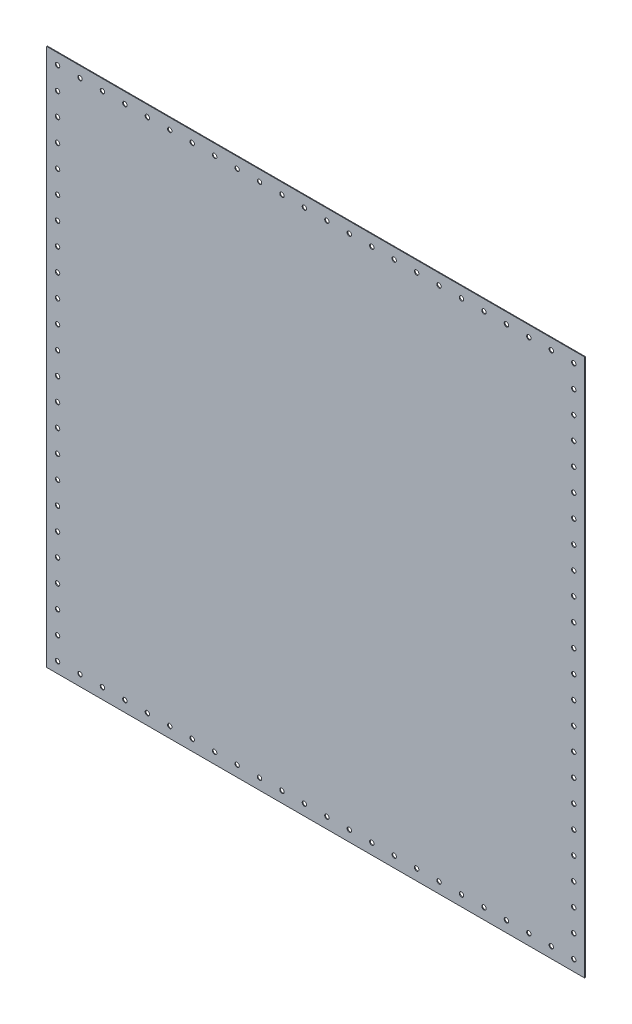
from build123d import *

# Parameters (mm, degrees)
SKETCH1_W           = 1196.975
SKETCH1_H           = 1196.975
BOSS_EXTRUDE1_DEPTH = 1.5875
SKETCH2_R           = 4.9022
CUT_EXTRUDE2_DEPTH  = 847.390628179


with BuildPart() as part:
    # Sketch1 → Boss-Extrude1 (new body)
    with BuildSketch(Plane.XY):
        Rectangle(SKETCH1_W, SKETCH1_H)
    extrude(amount=BOSS_EXTRUDE1_DEPTH)

    # Sketch2 → Cut-Extrude2 (cut, through all)
    with BuildSketch(Plane.XY):
        with Locations((574.3575, -574.3575)):
            Circle(SKETCH2_R)
        with Locations((-574.3575, -574.3575)):
            Circle(SKETCH2_R)
        with Locations((574.3575, -524.413369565)):
            Circle(SKETCH2_R)
        with Locations((-574.3575, -524.413369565)):
            Circle(SKETCH2_R)
        with Locations((574.3575, -474.46923913)):
            Circle(SKETCH2_R)
        with Locations((-574.3575, -474.46923913)):
            Circle(SKETCH2_R)
        with Locations((574.3575, -424.525108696)):
            Circle(SKETCH2_R)
        with Locations((-574.3575, -424.525108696)):
            Circle(SKETCH2_R)
        with Locations((574.3575, -374.580978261)):
            Circle(SKETCH2_R)
        with Locations((-574.3575, -374.580978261)):
            Circle(SKETCH2_R)
        with Locations((574.3575, -324.636847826)):
            Circle(SKETCH2_R)
        with Locations((-574.3575, -324.636847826)):
            Circle(SKETCH2_R)
        with Locations((574.3575, -274.692717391)):
            Circle(SKETCH2_R)
        with Locations((-574.3575, -274.692717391)):
            Circle(SKETCH2_R)
        with Locations((574.3575, -224.748586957)):
            Circle(SKETCH2_R)
        with Locations((-574.3575, -224.748586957)):
            Circle(SKETCH2_R)
        with Locations((574.3575, -174.804456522)):
            Circle(SKETCH2_R)
        with Locations((-574.3575, -174.804456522)):
            Circle(SKETCH2_R)
        with Locations((574.3575, -124.860326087)):
            Circle(SKETCH2_R)
        with Locations((-574.3575, -124.860326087)):
            Circle(SKETCH2_R)
        with Locations((574.3575, -74.916195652)):
            Circle(SKETCH2_R)
        with Locations((-574.3575, -74.916195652)):
            Circle(SKETCH2_R)
        with Locations((574.3575, -24.972065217)):
            Circle(SKETCH2_R)
        with Locations((-574.3575, -24.972065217)):
            Circle(SKETCH2_R)
        with Locations((574.3575, 24.972065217)):
            Circle(SKETCH2_R)
        with Locations((-574.3575, 24.972065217)):
            Circle(SKETCH2_R)
        with Locations((574.3575, 74.916195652)):
            Circle(SKETCH2_R)
        with Locations((-574.3575, 74.916195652)):
            Circle(SKETCH2_R)
        with Locations((574.3575, 124.860326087)):
            Circle(SKETCH2_R)
        with Locations((-574.3575, 124.860326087)):
            Circle(SKETCH2_R)
        with Locations((574.3575, 174.804456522)):
            Circle(SKETCH2_R)
        with Locations((-574.3575, 174.804456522)):
            Circle(SKETCH2_R)
        with Locations((574.3575, 224.748586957)):
            Circle(SKETCH2_R)
        with Locations((-574.3575, 224.748586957)):
            Circle(SKETCH2_R)
        with Locations((574.3575, 274.692717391)):
            Circle(SKETCH2_R)
        with Locations((-574.3575, 274.692717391)):
            Circle(SKETCH2_R)
        with Locations((574.3575, 324.636847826)):
            Circle(SKETCH2_R)
        with Locations((-574.3575, 324.636847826)):
            Circle(SKETCH2_R)
        with Locations((574.3575, 374.580978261)):
            Circle(SKETCH2_R)
        with Locations((-574.3575, 374.580978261)):
            Circle(SKETCH2_R)
        with Locations((574.3575, 424.525108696)):
            Circle(SKETCH2_R)
        with Locations((-574.3575, 424.525108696)):
            Circle(SKETCH2_R)
        with Locations((574.3575, 474.46923913)):
            Circle(SKETCH2_R)
        with Locations((-574.3575, 474.46923913)):
            Circle(SKETCH2_R)
        with Locations((574.3575, 524.413369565)):
            Circle(SKETCH2_R)
        with Locations((-574.3575, 524.413369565)):
            Circle(SKETCH2_R)
        with Locations((574.3575, 574.3575)):
            Circle(SKETCH2_R)
        with Locations((-574.3575, 574.3575)):
            Circle(SKETCH2_R)
        with Locations((-524.41336951, -574.3575)):
            Circle(SKETCH2_R)
        with Locations((-524.41336951, 574.3575)):
            Circle(SKETCH2_R)
        with Locations((-474.46923902, -574.3575)):
            Circle(SKETCH2_R)
        with Locations((-474.46923902, 574.3575)):
            Circle(SKETCH2_R)
        with Locations((-424.52510853, -574.3575)):
            Circle(SKETCH2_R)
        with Locations((-424.52510853, 574.3575)):
            Circle(SKETCH2_R)
        with Locations((-374.58097804, -574.3575)):
            Circle(SKETCH2_R)
        with Locations((-374.58097804, 574.3575)):
            Circle(SKETCH2_R)
        with Locations((-324.63684755, -574.3575)):
            Circle(SKETCH2_R)
        with Locations((-324.63684755, 574.3575)):
            Circle(SKETCH2_R)
        with Locations((-274.69271706, -574.3575)):
            Circle(SKETCH2_R)
        with Locations((-274.69271706, 574.3575)):
            Circle(SKETCH2_R)
        with Locations((-224.74858657, -574.3575)):
            Circle(SKETCH2_R)
        with Locations((-224.74858657, 574.3575)):
            Circle(SKETCH2_R)
        with Locations((-174.80445608, -574.3575)):
            Circle(SKETCH2_R)
        with Locations((-174.80445608, 574.3575)):
            Circle(SKETCH2_R)
        with Locations((-124.86032559, -574.3575)):
            Circle(SKETCH2_R)
        with Locations((-124.86032559, 574.3575)):
            Circle(SKETCH2_R)
        with Locations((-74.9161951, -574.3575)):
            Circle(SKETCH2_R)
        with Locations((-74.9161951, 574.3575)):
            Circle(SKETCH2_R)
        with Locations((-24.97206461, -574.3575)):
            Circle(SKETCH2_R)
        with Locations((-24.97206461, 574.3575)):
            Circle(SKETCH2_R)
        with Locations((24.97206588, -574.3575)):
            Circle(SKETCH2_R)
        with Locations((24.97206588, 574.3575)):
            Circle(SKETCH2_R)
        with Locations((74.91619637, -574.3575)):
            Circle(SKETCH2_R)
        with Locations((74.91619637, 574.3575)):
            Circle(SKETCH2_R)
        with Locations((124.86032686, -574.3575)):
            Circle(SKETCH2_R)
        with Locations((124.86032686, 574.3575)):
            Circle(SKETCH2_R)
        with Locations((174.80445735, -574.3575)):
            Circle(SKETCH2_R)
        with Locations((174.80445735, 574.3575)):
            Circle(SKETCH2_R)
        with Locations((224.74858784, -574.3575)):
            Circle(SKETCH2_R)
        with Locations((224.74858784, 574.3575)):
            Circle(SKETCH2_R)
        with Locations((274.69271833, -574.3575)):
            Circle(SKETCH2_R)
        with Locations((274.69271833, 574.3575)):
            Circle(SKETCH2_R)
        with Locations((324.63684882, -574.3575)):
            Circle(SKETCH2_R)
        with Locations((324.63684882, 574.3575)):
            Circle(SKETCH2_R)
        with Locations((374.58097931, -574.3575)):
            Circle(SKETCH2_R)
        with Locations((374.58097931, 574.3575)):
            Circle(SKETCH2_R)
        with Locations((424.5251098, -574.3575)):
            Circle(SKETCH2_R)
        with Locations((424.5251098, 574.3575)):
            Circle(SKETCH2_R)
        with Locations((474.46924029, -574.3575)):
            Circle(SKETCH2_R)
        with Locations((474.46924029, 574.3575)):
            Circle(SKETCH2_R)
        with Locations((524.41337078, -574.3575)):
            Circle(SKETCH2_R)
        with Locations((524.41337078, 574.3575)):
            Circle(SKETCH2_R)
    extrude(amount=CUT_EXTRUDE2_DEPTH, mode=Mode.SUBTRACT)


solid = part.part
